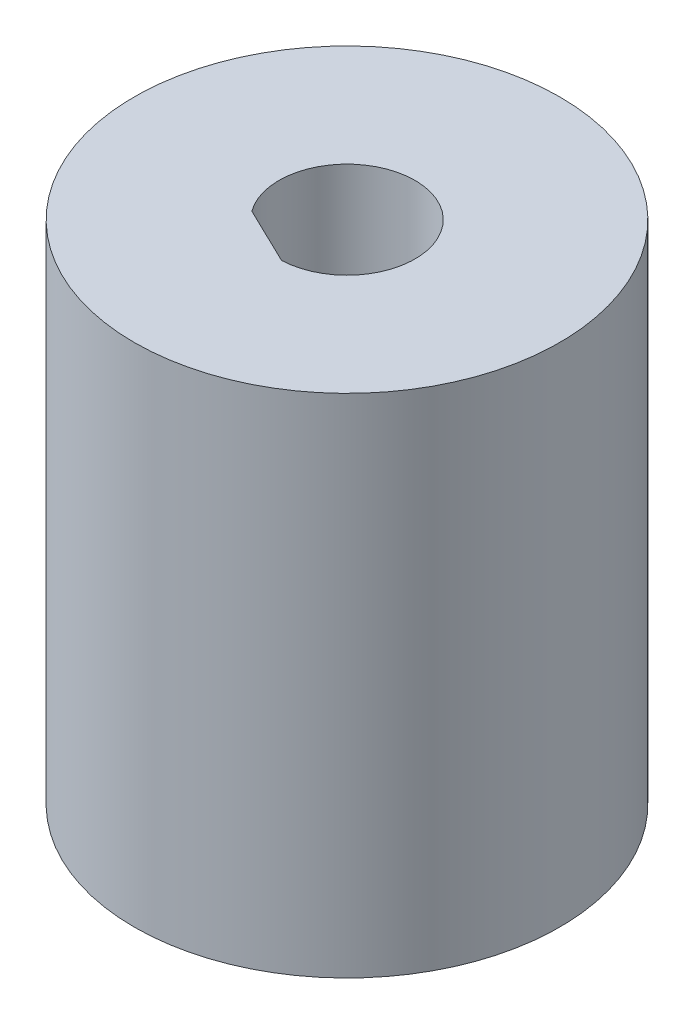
from build123d import *

# Parameters (mm, degrees)
SKETCH1_R           = 5
BOSS_EXTRUDE1_DEPTH = 11.9
CUT_EXTRUDE1_DEPTH  = 14.842326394


with BuildPart() as part:
    # Sketch1 → Boss-Extrude1 (new body)
    with BuildSketch(Plane(origin=(0, 0, 0), x_dir=(1, 0, 0), z_dir=(0, 1, 0))):
        with Locations(Location((0, 0, 0), (0, 0, 270))):
            Circle(SKETCH1_R)
    extrude(amount=BOSS_EXTRUDE1_DEPTH)

    # Sketch2 → Cut-Extrude1 (cut, through all)
    with BuildSketch(Plane(origin=(0, 11.9, 0), x_dir=(1, 0, 0), z_dir=(0, 1, 0))):
        with BuildLine():
            ThreePointArc((1.6, 0), (-0.497362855, 1.520733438), (-1.290787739, -0.945445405))
            Line((-1.290787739, -0.945445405), (0.059397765, -1.59889709))
            ThreePointArc((0.059397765, -1.59889709), (1.152179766, -1.110171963), (1.6, 0))
        make_face()
    extrude(amount=-CUT_EXTRUDE1_DEPTH, mode=Mode.SUBTRACT)


solid = part.part
